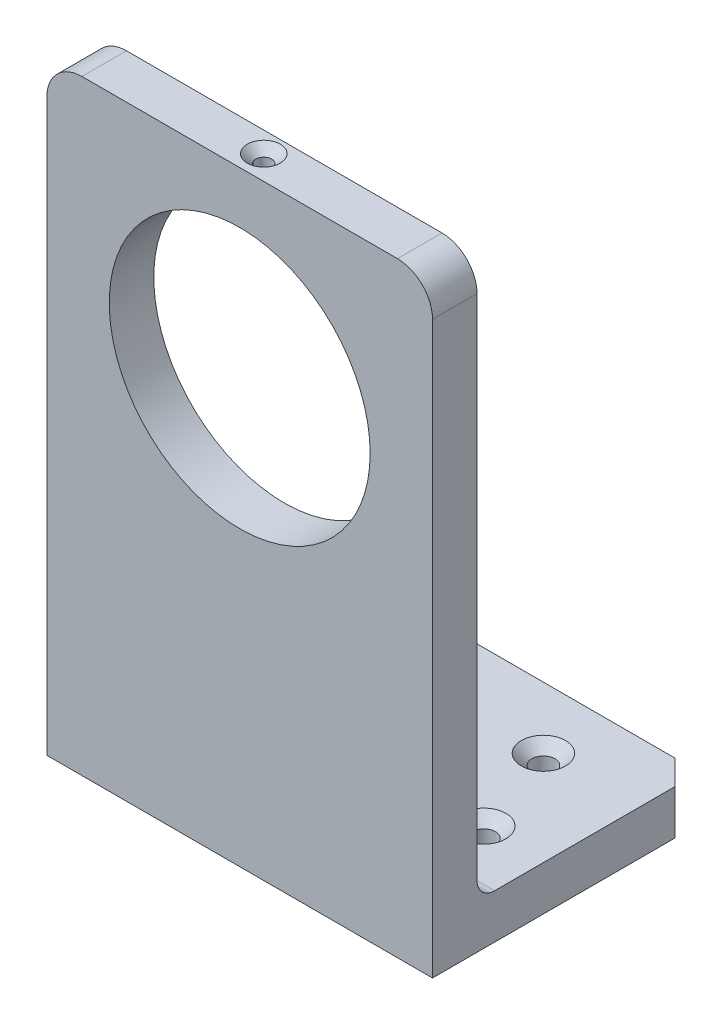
ISO-10303-21;
HEADER;
FILE_DESCRIPTION(('STEP AP214'),'2;1');
FILE_NAME('part.step','',(''),(''),'','','');
FILE_SCHEMA(('AUTOMOTIVE_DESIGN { 1 0 10303 214 1 1 1 1 }'));
ENDSEC;
DATA;
#1=APPLICATION_CONTEXT('core data for automotive mechanical design processes');
#2=APPLICATION_PROTOCOL_DEFINITION('international standard','automotive_design',2000,#1);
#3=PRODUCT_CONTEXT('',#1,'mechanical');
#4=PRODUCT('Part','Part','',(#3));
#5=PRODUCT_RELATED_PRODUCT_CATEGORY('part','',(#4));
#6=PRODUCT_DEFINITION_FORMATION('','',#4);
#7=PRODUCT_DEFINITION_CONTEXT('part definition',#1,'design');
#8=PRODUCT_DEFINITION('design','',#6,#7);
#9=PRODUCT_DEFINITION_SHAPE('','',#8);
#10=(LENGTH_UNIT() NAMED_UNIT(*) SI_UNIT(.MILLI.,.METRE.));
#11=(NAMED_UNIT(*) PLANE_ANGLE_UNIT() SI_UNIT($,.RADIAN.));
#12=(NAMED_UNIT(*) SI_UNIT($,.STERADIAN.) SOLID_ANGLE_UNIT());
#13=UNCERTAINTY_MEASURE_WITH_UNIT(LENGTH_MEASURE(1.E-05),#10,'distance_accuracy_value','');
#14=(GEOMETRIC_REPRESENTATION_CONTEXT(3) GLOBAL_UNCERTAINTY_ASSIGNED_CONTEXT((#13)) GLOBAL_UNIT_ASSIGNED_CONTEXT((#10,
#11,#12)) REPRESENTATION_CONTEXT('',''));
#15=CARTESIAN_POINT('',(0.,0.,0.));
#16=DIRECTION('',(0.,0.,1.));
#17=DIRECTION('',(1.,0.,0.));
#18=AXIS2_PLACEMENT_3D('',#15,#16,#17);
#19=CARTESIAN_POINT('',(-55.,0.,12.7));
#20=DIRECTION('',(0.,0.,1.));
#21=DIRECTION('',(1.,0.,0.));
#22=AXIS2_PLACEMENT_3D('',#19,#20,#21);
#23=PLANE('',#22);
#24=DIRECTION('',(-1.,0.,0.));
#25=VECTOR('',#24,1.);
#26=CARTESIAN_POINT('',(55.,160.,12.7));
#27=LINE('',#26,#25);
#28=CARTESIAN_POINT('',(45.,160.,12.7));
#29=VERTEX_POINT('',#28);
#30=CARTESIAN_POINT('',(-45.,160.,12.7));
#31=VERTEX_POINT('',#30);
#32=EDGE_CURVE('E166',#29,#31,#27,.T.);
#33=ORIENTED_EDGE('',*,*,#32,.T.);
#34=CARTESIAN_POINT('',(-45.,150.,12.7));
#35=DIRECTION('',(0.,0.,1.));
#36=DIRECTION('',(1.,0.,0.));
#37=AXIS2_PLACEMENT_3D('',#34,#35,#36);
#38=CIRCLE('',#37,10.);
#39=CARTESIAN_POINT('',(-55.,150.,12.7));
#40=VERTEX_POINT('',#39);
#41=EDGE_CURVE('E120',#31,#40,#38,.T.);
#42=ORIENTED_EDGE('',*,*,#41,.T.);
#43=DIRECTION('',(0.,-1.,0.));
#44=VECTOR('',#43,1.);
#45=CARTESIAN_POINT('',(-55.,160.,12.7));
#46=LINE('',#45,#44);
#47=CARTESIAN_POINT('',(-55.,-12.7,12.7));
#48=VERTEX_POINT('',#47);
#49=EDGE_CURVE('E112',#40,#48,#46,.T.);
#50=ORIENTED_EDGE('',*,*,#49,.T.);
#51=DIRECTION('',(1.,0.,0.));
#52=VECTOR('',#51,1.);
#53=CARTESIAN_POINT('',(-55.,-12.7,12.7));
#54=LINE('',#53,#52);
#55=CARTESIAN_POINT('',(55.,-12.7,12.7));
#56=VERTEX_POINT('',#55);
#57=EDGE_CURVE('E118',#48,#56,#54,.T.);
#58=ORIENTED_EDGE('',*,*,#57,.T.);
#59=DIRECTION('',(0.,1.,0.));
#60=VECTOR('',#59,1.);
#61=CARTESIAN_POINT('',(55.,160.,12.7));
#62=LINE('',#61,#60);
#63=CARTESIAN_POINT('',(55.,150.,12.7));
#64=VERTEX_POINT('',#63);
#65=EDGE_CURVE('E124',#56,#64,#62,.T.);
#66=ORIENTED_EDGE('',*,*,#65,.T.);
#67=CARTESIAN_POINT('',(45.,150.,12.7));
#68=DIRECTION('',(0.,0.,1.));
#69=DIRECTION('',(1.,0.,0.));
#70=AXIS2_PLACEMENT_3D('',#67,#68,#69);
#71=CIRCLE('',#70,10.);
#72=EDGE_CURVE('E198',#64,#29,#71,.T.);
#73=ORIENTED_EDGE('',*,*,#72,.T.);
#74=EDGE_LOOP('',(#33,#42,#50,#58,#66,#73));
#75=FACE_BOUND('',#74,.T.);
#76=CARTESIAN_POINT('',(0.,108.,12.7));
#77=DIRECTION('',(0.,0.,1.));
#78=DIRECTION('',(1.,0.,0.));
#79=AXIS2_PLACEMENT_3D('',#76,#77,#78);
#80=CIRCLE('',#79,37.211);
#81=CARTESIAN_POINT('',(37.211,108.,12.7));
#82=VERTEX_POINT('',#81);
#83=EDGE_CURVE('E186',#82,#82,#80,.T.);
#84=ORIENTED_EDGE('',*,*,#83,.F.);
#85=EDGE_LOOP('',(#84));
#86=FACE_BOUND('',#85,.T.);
#87=ADVANCED_FACE('F30',(#75,#86),#23,.T.);
#88=CARTESIAN_POINT('',(-55.,0.,0.));
#89=DIRECTION('',(0.,0.,1.));
#90=DIRECTION('',(1.,0.,0.));
#91=AXIS2_PLACEMENT_3D('',#88,#89,#90);
#92=PLANE('',#91);
#93=DIRECTION('',(0.,1.,0.));
#94=VECTOR('',#93,1.);
#95=CARTESIAN_POINT('',(55.,160.,0.));
#96=LINE('',#95,#94);
#97=CARTESIAN_POINT('',(55.,5.,0.));
#98=VERTEX_POINT('',#97);
#99=CARTESIAN_POINT('',(55.,150.,0.));
#100=VERTEX_POINT('',#99);
#101=EDGE_CURVE('E185',#98,#100,#96,.T.);
#102=ORIENTED_EDGE('',*,*,#101,.F.);
#103=DIRECTION('',(1.,0.,0.));
#104=VECTOR('',#103,1.);
#105=CARTESIAN_POINT('',(-55.,5.,0.));
#106=LINE('',#105,#104);
#107=CARTESIAN_POINT('',(-55.,5.,0.));
#108=VERTEX_POINT('',#107);
#109=EDGE_CURVE('E51',#98,#108,#106,.F.);
#110=ORIENTED_EDGE('',*,*,#109,.T.);
#111=DIRECTION('',(0.,-1.,0.));
#112=VECTOR('',#111,1.);
#113=CARTESIAN_POINT('',(-55.,160.,0.));
#114=LINE('',#113,#112);
#115=CARTESIAN_POINT('',(-55.,150.,0.));
#116=VERTEX_POINT('',#115);
#117=EDGE_CURVE('E183',#116,#108,#114,.T.);
#118=ORIENTED_EDGE('',*,*,#117,.F.);
#119=CARTESIAN_POINT('',(-45.,150.,0.));
#120=DIRECTION('',(0.,0.,1.));
#121=DIRECTION('',(1.,0.,0.));
#122=AXIS2_PLACEMENT_3D('',#119,#120,#121);
#123=CIRCLE('',#122,10.);
#124=CARTESIAN_POINT('',(-45.,160.,0.));
#125=VERTEX_POINT('',#124);
#126=EDGE_CURVE('E191',#116,#125,#123,.F.);
#127=ORIENTED_EDGE('',*,*,#126,.T.);
#128=DIRECTION('',(-1.,0.,0.));
#129=VECTOR('',#128,1.);
#130=CARTESIAN_POINT('',(55.,160.,0.));
#131=LINE('',#130,#129);
#132=CARTESIAN_POINT('',(45.,160.,0.));
#133=VERTEX_POINT('',#132);
#134=EDGE_CURVE('E125',#133,#125,#131,.T.);
#135=ORIENTED_EDGE('',*,*,#134,.F.);
#136=CARTESIAN_POINT('',(45.,150.,0.));
#137=DIRECTION('',(0.,0.,1.));
#138=DIRECTION('',(1.,0.,0.));
#139=AXIS2_PLACEMENT_3D('',#136,#137,#138);
#140=CIRCLE('',#139,10.);
#141=EDGE_CURVE('E188',#133,#100,#140,.F.);
#142=ORIENTED_EDGE('',*,*,#141,.T.);
#143=EDGE_LOOP('',(#102,#110,#118,#127,#135,#142));
#144=FACE_BOUND('',#143,.T.);
#145=CARTESIAN_POINT('',(0.,108.,0.));
#146=DIRECTION('',(0.,0.,1.));
#147=DIRECTION('',(1.,0.,0.));
#148=AXIS2_PLACEMENT_3D('',#145,#146,#147);
#149=CIRCLE('',#148,37.211);
#150=CARTESIAN_POINT('',(37.211,108.,0.));
#151=VERTEX_POINT('',#150);
#152=EDGE_CURVE('E160',#151,#151,#149,.T.);
#153=ORIENTED_EDGE('',*,*,#152,.T.);
#154=EDGE_LOOP('',(#153));
#155=FACE_BOUND('',#154,.T.);
#156=ADVANCED_FACE('F221',(#144,#155),#92,.F.);
#157=CARTESIAN_POINT('',(-55.,160.,12.7));
#158=DIRECTION('',(1.,0.,0.));
#159=DIRECTION('',(0.,1.,0.));
#160=AXIS2_PLACEMENT_3D('',#157,#158,#159);
#161=PLANE('',#160);
#162=ORIENTED_EDGE('',*,*,#49,.F.);
#163=DIRECTION('',(0.,0.,-1.));
#164=VECTOR('',#163,1.);
#165=CARTESIAN_POINT('',(-55.,150.,12.7));
#166=LINE('',#165,#164);
#167=EDGE_CURVE('E182',#40,#116,#166,.T.);
#168=ORIENTED_EDGE('',*,*,#167,.T.);
#169=ORIENTED_EDGE('',*,*,#117,.T.);
#170=CARTESIAN_POINT('',(-55.,5.,-5.));
#171=DIRECTION('',(1.,0.,0.));
#172=DIRECTION('',(0.,1.,0.));
#173=AXIS2_PLACEMENT_3D('',#170,#171,#172);
#174=CIRCLE('',#173,5.);
#175=CARTESIAN_POINT('',(-55.,0.,-5.00000000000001));
#176=VERTEX_POINT('',#175);
#177=EDGE_CURVE('E11',#108,#176,#174,.T.);
#178=ORIENTED_EDGE('',*,*,#177,.T.);
#179=DIRECTION('',(0.,0.,1.));
#180=VECTOR('',#179,1.);
#181=CARTESIAN_POINT('',(-55.,0.,-63.5));
#182=LINE('',#181,#180);
#183=CARTESIAN_POINT('',(-55.,0.,-56.5));
#184=VERTEX_POINT('',#183);
#185=EDGE_CURVE('E156',#184,#176,#182,.T.);
#186=ORIENTED_EDGE('',*,*,#185,.F.);
#187=DIRECTION('',(0.,-1.,0.));
#188=VECTOR('',#187,1.);
#189=CARTESIAN_POINT('',(-55.,160.,-56.5));
#190=LINE('',#189,#188);
#191=CARTESIAN_POINT('',(-55.,-12.7,-56.5));
#192=VERTEX_POINT('',#191);
#193=EDGE_CURVE('E133',#184,#192,#190,.T.);
#194=ORIENTED_EDGE('',*,*,#193,.T.);
#195=DIRECTION('',(0.,0.,1.));
#196=VECTOR('',#195,1.);
#197=CARTESIAN_POINT('',(-55.,-12.7,-63.5));
#198=LINE('',#197,#196);
#199=EDGE_CURVE('E129',#192,#48,#198,.T.);
#200=ORIENTED_EDGE('',*,*,#199,.T.);
#201=EDGE_LOOP('',(#162,#168,#169,#178,#186,#194,#200));
#202=FACE_BOUND('',#201,.T.);
#203=ADVANCED_FACE('F130',(#202),#161,.F.);
#204=CARTESIAN_POINT('',(55.,160.,12.7));
#205=DIRECTION('',(-1.,0.,0.));
#206=DIRECTION('',(0.,-1.,0.));
#207=AXIS2_PLACEMENT_3D('',#204,#205,#206);
#208=PLANE('',#207);
#209=DIRECTION('',(0.,0.,1.));
#210=VECTOR('',#209,1.);
#211=CARTESIAN_POINT('',(55.,0.,-63.5));
#212=LINE('',#211,#210);
#213=CARTESIAN_POINT('',(55.,0.,-56.5));
#214=VERTEX_POINT('',#213);
#215=CARTESIAN_POINT('',(55.,0.,-5.00000000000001));
#216=VERTEX_POINT('',#215);
#217=EDGE_CURVE('E161',#214,#216,#212,.T.);
#218=ORIENTED_EDGE('',*,*,#217,.T.);
#219=CARTESIAN_POINT('',(55.,5.,-5.));
#220=DIRECTION('',(-1.,0.,0.));
#221=DIRECTION('',(0.,-1.,0.));
#222=AXIS2_PLACEMENT_3D('',#219,#220,#221);
#223=CIRCLE('',#222,5.);
#224=EDGE_CURVE('E38',#216,#98,#223,.T.);
#225=ORIENTED_EDGE('',*,*,#224,.T.);
#226=ORIENTED_EDGE('',*,*,#101,.T.);
#227=DIRECTION('',(0.,0.,-1.));
#228=VECTOR('',#227,1.);
#229=CARTESIAN_POINT('',(55.,150.,12.7));
#230=LINE('',#229,#228);
#231=EDGE_CURVE('E201',#100,#64,#230,.F.);
#232=ORIENTED_EDGE('',*,*,#231,.T.);
#233=ORIENTED_EDGE('',*,*,#65,.F.);
#234=DIRECTION('',(0.,0.,1.));
#235=VECTOR('',#234,1.);
#236=CARTESIAN_POINT('',(55.,-12.7,-63.5));
#237=LINE('',#236,#235);
#238=CARTESIAN_POINT('',(55.,-12.7,-56.5));
#239=VERTEX_POINT('',#238);
#240=EDGE_CURVE('E135',#239,#56,#237,.T.);
#241=ORIENTED_EDGE('',*,*,#240,.F.);
#242=DIRECTION('',(0.,1.,0.));
#243=VECTOR('',#242,1.);
#244=CARTESIAN_POINT('',(55.,160.,-56.5));
#245=LINE('',#244,#243);
#246=EDGE_CURVE('E179',#239,#214,#245,.T.);
#247=ORIENTED_EDGE('',*,*,#246,.T.);
#248=EDGE_LOOP('',(#218,#225,#226,#232,#233,#241,#247));
#249=FACE_BOUND('',#248,.T.);
#250=ADVANCED_FACE('F233',(#249),#208,.F.);
#251=CARTESIAN_POINT('',(55.,160.,12.7));
#252=DIRECTION('',(0.,-1.,0.));
#253=DIRECTION('',(0.,0.,-1.));
#254=AXIS2_PLACEMENT_3D('',#251,#252,#253);
#255=PLANE('',#254);
#256=CARTESIAN_POINT('',(0.,160.,5.83424471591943));
#257=DIRECTION('',(0.,1.,0.));
#258=DIRECTION('',(0.,0.,1.));
#259=AXIS2_PLACEMENT_3D('',#256,#257,#258);
#260=CIRCLE('',#259,4.7);
#261=CARTESIAN_POINT('',(0.,160.,10.5342447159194));
#262=VERTEX_POINT('',#261);
#263=EDGE_CURVE('E349',#262,#262,#260,.T.);
#264=ORIENTED_EDGE('',*,*,#263,.F.);
#265=EDGE_LOOP('',(#264));
#266=FACE_BOUND('',#265,.T.);
#267=ORIENTED_EDGE('',*,*,#134,.T.);
#268=DIRECTION('',(0.,0.,-1.));
#269=VECTOR('',#268,1.);
#270=CARTESIAN_POINT('',(-45.,160.,12.7));
#271=LINE('',#270,#269);
#272=EDGE_CURVE('E196',#125,#31,#271,.F.);
#273=ORIENTED_EDGE('',*,*,#272,.T.);
#274=ORIENTED_EDGE('',*,*,#32,.F.);
#275=DIRECTION('',(0.,0.,-1.));
#276=VECTOR('',#275,1.);
#277=CARTESIAN_POINT('',(45.,160.,12.7));
#278=LINE('',#277,#276);
#279=EDGE_CURVE('E193',#29,#133,#278,.T.);
#280=ORIENTED_EDGE('',*,*,#279,.T.);
#281=EDGE_LOOP('',(#267,#273,#274,#280));
#282=FACE_BOUND('',#281,.T.);
#283=ADVANCED_FACE('F230',(#266,#282),#255,.F.);
#284=CARTESIAN_POINT('',(0.,108.,12.7));
#285=DIRECTION('',(0.,0.,-1.));
#286=DIRECTION('',(-1.,0.,0.));
#287=AXIS2_PLACEMENT_3D('',#284,#285,#286);
#288=CYLINDRICAL_SURFACE('',#287,37.211);
#289=CARTESIAN_POINT('',(0.,145.211,8.08424471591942));
#290=CARTESIAN_POINT('',(-0.126259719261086,145.210999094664,8.08423915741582));
#291=CARTESIAN_POINT('',(-0.252608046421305,145.210350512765,8.0735813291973));
#292=CARTESIAN_POINT('',(-0.501816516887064,145.207825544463,8.03121778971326));
#293=CARTESIAN_POINT('',(-0.624672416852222,145.205947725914,7.99948752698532));
#294=CARTESIAN_POINT('',(-0.863250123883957,145.201176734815,7.91589330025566));
#295=CARTESIAN_POINT('',(-0.978975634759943,145.19828409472,7.8640398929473));
#296=CARTESIAN_POINT('',(-1.20004966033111,145.191808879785,7.74168826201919));
#297=CARTESIAN_POINT('',(-1.3054005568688,145.188226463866,7.67119433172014));
#298=CARTESIAN_POINT('',(-1.50291393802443,145.180768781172,7.51345347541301));
#299=CARTESIAN_POINT('',(-1.59505986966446,145.176893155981,7.42618583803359));
#300=CARTESIAN_POINT('',(-1.76340615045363,145.169288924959,7.23741727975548));
#301=CARTESIAN_POINT('',(-1.8396058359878,145.165560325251,7.13591576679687));
#302=CARTESIAN_POINT('',(-1.97394688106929,145.158667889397,6.92146790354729));
#303=CARTESIAN_POINT('',(-2.03207459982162,145.15550448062,6.80851299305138));
#304=CARTESIAN_POINT('',(-2.12853436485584,145.150103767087,6.57442475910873));
#305=CARTESIAN_POINT('',(-2.16686661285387,145.147866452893,6.45329151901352));
#306=CARTESIAN_POINT('',(-2.22260167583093,145.144573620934,6.20644367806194));
#307=CARTESIAN_POINT('',(-2.24003026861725,145.143516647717,6.08073491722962));
#308=CARTESIAN_POINT('',(-2.2535428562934,145.142699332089,5.82817200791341));
#309=CARTESIAN_POINT('',(-2.24962707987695,145.142938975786,5.70131787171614));
#310=CARTESIAN_POINT('',(-2.22058348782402,145.144686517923,5.45024070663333));
#311=CARTESIAN_POINT('',(-2.19548355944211,145.146192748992,5.32601443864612));
#312=CARTESIAN_POINT('',(-2.12482740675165,145.150301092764,5.08354165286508));
#313=CARTESIAN_POINT('',(-2.07927106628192,145.15290321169,4.96529516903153));
#314=CARTESIAN_POINT('',(-1.96896357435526,145.158912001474,4.73804889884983));
#315=CARTESIAN_POINT('',(-1.90419976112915,145.162319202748,4.62905527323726));
#316=CARTESIAN_POINT('',(-1.75732491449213,145.169553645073,4.42347600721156));
#317=CARTESIAN_POINT('',(-1.67521369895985,145.173380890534,4.3268904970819));
#318=CARTESIAN_POINT('',(-1.49581776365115,145.181031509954,4.1487069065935));
#319=CARTESIAN_POINT('',(-1.39850890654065,145.184854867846,4.06713312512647));
#320=CARTESIAN_POINT('',(-1.19156458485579,145.192060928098,3.92147596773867));
#321=CARTESIAN_POINT('',(-1.08192911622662,145.195443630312,3.85739259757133));
#322=CARTESIAN_POINT('',(-0.853429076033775,145.20138743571,3.74853746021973));
#323=CARTESIAN_POINT('',(-0.73456407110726,145.203948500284,3.70376660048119));
#324=CARTESIAN_POINT('',(-0.490985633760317,145.207959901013,3.63482353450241));
#325=CARTESIAN_POINT('',(-0.366272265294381,145.20941024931,3.61065110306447));
#326=CARTESIAN_POINT('',(-0.114748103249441,145.21103521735,3.5836211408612));
#327=CARTESIAN_POINT('',(0.0120590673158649,145.211211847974,3.58073001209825));
#328=CARTESIAN_POINT('',(0.264356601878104,145.210274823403,3.59625695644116));
#329=CARTESIAN_POINT('',(0.389846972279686,145.209161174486,3.6146749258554));
#330=CARTESIAN_POINT('',(0.635854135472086,145.205770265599,3.67226943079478));
#331=CARTESIAN_POINT('',(0.75637454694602,145.203493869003,3.71143056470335));
#332=CARTESIAN_POINT('',(0.989132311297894,145.198033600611,3.80938412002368));
#333=CARTESIAN_POINT('',(1.10136959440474,145.194849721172,3.86817670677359));
#334=CARTESIAN_POINT('',(1.31452902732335,145.187927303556,4.00380987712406));
#335=CARTESIAN_POINT('',(1.41543686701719,145.184188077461,4.08067291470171));
#336=CARTESIAN_POINT('',(1.6029289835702,145.176578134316,4.25023242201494));
#337=CARTESIAN_POINT('',(1.68951312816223,145.172707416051,4.34292903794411));
#338=CARTESIAN_POINT('',(1.84601373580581,145.165264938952,4.54166926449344));
#339=CARTESIAN_POINT('',(1.91590841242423,145.161693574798,4.64773004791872));
#340=CARTESIAN_POINT('',(2.0368970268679,145.155258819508,4.87010154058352));
#341=CARTESIAN_POINT('',(2.08799107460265,145.152395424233,4.98641218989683));
#342=CARTESIAN_POINT('',(2.16989028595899,145.147702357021,5.22590200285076));
#343=CARTESIAN_POINT('',(2.20070919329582,145.145871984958,5.34907645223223));
#344=CARTESIAN_POINT('',(2.24122818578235,145.143449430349,5.59886296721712));
#345=CARTESIAN_POINT('',(2.25092846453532,145.142857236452,5.72547500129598));
#346=CARTESIAN_POINT('',(2.24893299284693,145.142978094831,5.97832596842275));
#347=CARTESIAN_POINT('',(2.23727149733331,145.143689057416,6.10456517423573));
#348=CARTESIAN_POINT('',(2.19295448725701,145.146331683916,6.35328965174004));
#349=CARTESIAN_POINT('',(2.16029893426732,145.148263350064,6.47577491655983));
#350=CARTESIAN_POINT('',(2.07492837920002,145.153129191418,6.71352009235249));
#351=CARTESIAN_POINT('',(2.02221346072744,145.156063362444,6.82878003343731));
#352=CARTESIAN_POINT('',(1.89822543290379,145.162603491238,7.04881756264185));
#353=CARTESIAN_POINT('',(1.82695281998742,145.166209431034,7.15359543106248));
#354=CARTESIAN_POINT('',(1.66774643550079,145.173693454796,7.34986792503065));
#355=CARTESIAN_POINT('',(1.57978801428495,145.177571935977,7.44134254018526));
#356=CARTESIAN_POINT('',(1.38973778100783,145.185160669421,7.6082586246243));
#357=CARTESIAN_POINT('',(1.28764251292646,145.188870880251,7.683696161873));
#358=CARTESIAN_POINT('',(1.07210692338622,145.195708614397,7.81644860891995));
#359=CARTESIAN_POINT('',(0.958653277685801,145.198835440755,7.87374189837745));
#360=CARTESIAN_POINT('',(0.723800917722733,145.204144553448,7.96839676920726));
#361=CARTESIAN_POINT('',(0.602411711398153,145.206327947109,8.00578172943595));
#362=CARTESIAN_POINT('',(0.400231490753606,145.208931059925,8.04982616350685));
#363=CARTESIAN_POINT('',(0.320747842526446,145.209703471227,8.06271646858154));
#364=CARTESIAN_POINT('',(0.160854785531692,145.21073822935,8.0799275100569));
#365=CARTESIAN_POINT('',(0.0804453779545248,145.211000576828,8.08424825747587));
#366=CARTESIAN_POINT('',(0.,145.211,8.08424471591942));
#367=B_SPLINE_CURVE_WITH_KNOTS('',3,(#289,#290,#291,#292,#293,#294,#295,#296,#297,#298,#299,
#300,#301,#302,#303,#304,#305,#306,#307,#308,#309,#310,#311,#312,#313,#314,#315,#316,#317,#318,
#319,#320,#321,#322,#323,#324,#325,#326,#327,#328,#329,#330,#331,#332,#333,#334,#335,#336,#337,
#338,#339,#340,#341,#342,#343,#344,#345,#346,#347,#348,#349,#350,#351,#352,#353,#354,#355,#356,
#357,#358,#359,#360,#361,#362,#363,#364,#365,#366),.UNSPECIFIED.,.T.,.F.,(4,2,2,2,2,2,2,2,2,2,2,
2,2,2,2,2,2,2,2,2,2,2,2,2,2,2,2,2,2,2,2,2,2,2,2,2,2,2,4),(0.,0.378485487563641,
0.757412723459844,1.13614144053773,1.51478300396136,1.89389513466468,2.27302303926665,
2.65243642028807,3.03184593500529,3.41078708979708,3.78972418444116,4.16816321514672,
4.54660439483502,4.92529560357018,5.30399078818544,5.68329366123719,6.06259665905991,
6.44191747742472,6.82123414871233,7.19995184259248,7.57866769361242,7.95710274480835,
8.33554098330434,8.71445197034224,9.09336645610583,9.47277290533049,9.85217713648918,
10.2313239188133,10.6104672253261,10.9890030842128,11.3675396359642,11.7460746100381,
12.1245994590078,12.5036879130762,12.8828692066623,13.262500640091,13.6416852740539,
13.8828346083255,14.1239836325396),.UNSPECIFIED.);
#368=CARTESIAN_POINT('',(0.,145.211,8.08424471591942));
#369=VERTEX_POINT('',#368);
#370=EDGE_CURVE('E342',#369,#369,#367,.T.);
#371=ORIENTED_EDGE('',*,*,#370,.F.);
#372=EDGE_LOOP('',(#371));
#373=FACE_BOUND('',#372,.T.);
#374=ORIENTED_EDGE('',*,*,#83,.T.);
#375=EDGE_LOOP('',(#374));
#376=FACE_BOUND('',#375,.T.);
#377=ORIENTED_EDGE('',*,*,#152,.F.);
#378=EDGE_LOOP('',(#377));
#379=FACE_BOUND('',#378,.T.);
#380=ADVANCED_FACE('F218',(#373,#376,#379),#288,.F.);
#381=CARTESIAN_POINT('',(-55.,0.,-63.5));
#382=DIRECTION('',(0.,1.,0.));
#383=DIRECTION('',(0.,0.,1.));
#384=AXIS2_PLACEMENT_3D('',#381,#382,#383);
#385=PLANE('',#384);
#386=CARTESIAN_POINT('',(-30.,0.,-45.9319172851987));
#387=DIRECTION('',(0.,1.,0.));
#388=DIRECTION('',(0.,0.,1.));
#389=AXIS2_PLACEMENT_3D('',#386,#387,#388);
#390=CIRCLE('',#389,6.3);
#391=CARTESIAN_POINT('',(-30.,0.,-39.6319172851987));
#392=VERTEX_POINT('',#391);
#393=EDGE_CURVE('E304',#392,#392,#390,.T.);
#394=ORIENTED_EDGE('',*,*,#393,.F.);
#395=EDGE_LOOP('',(#394));
#396=FACE_BOUND('',#395,.T.);
#397=CARTESIAN_POINT('',(28.,0.,-45.9319172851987));
#398=DIRECTION('',(0.,1.,0.));
#399=DIRECTION('',(0.,0.,1.));
#400=AXIS2_PLACEMENT_3D('',#397,#398,#399);
#401=CIRCLE('',#400,6.3);
#402=CARTESIAN_POINT('',(28.,0.,-39.6319172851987));
#403=VERTEX_POINT('',#402);
#404=EDGE_CURVE('E308',#403,#403,#401,.T.);
#405=ORIENTED_EDGE('',*,*,#404,.F.);
#406=EDGE_LOOP('',(#405));
#407=FACE_BOUND('',#406,.T.);
#408=CARTESIAN_POINT('',(37.5,0.,-19.4326116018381));
#409=DIRECTION('',(0.,1.,0.));
#410=DIRECTION('',(0.,0.,1.));
#411=AXIS2_PLACEMENT_3D('',#408,#409,#410);
#412=CIRCLE('',#411,6.3);
#413=CARTESIAN_POINT('',(37.5,0.,-13.1326116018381));
#414=VERTEX_POINT('',#413);
#415=EDGE_CURVE('E312',#414,#414,#412,.T.);
#416=ORIENTED_EDGE('',*,*,#415,.F.);
#417=EDGE_LOOP('',(#416));
#418=FACE_BOUND('',#417,.T.);
#419=CARTESIAN_POINT('',(-37.5,0.,-19.4326116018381));
#420=DIRECTION('',(0.,1.,0.));
#421=DIRECTION('',(0.,0.,1.));
#422=AXIS2_PLACEMENT_3D('',#419,#420,#421);
#423=CIRCLE('',#422,6.3);
#424=CARTESIAN_POINT('',(-37.5,0.,-13.1326116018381));
#425=VERTEX_POINT('',#424);
#426=EDGE_CURVE('E315',#425,#425,#423,.T.);
#427=ORIENTED_EDGE('',*,*,#426,.F.);
#428=EDGE_LOOP('',(#427));
#429=FACE_BOUND('',#428,.T.);
#430=ORIENTED_EDGE('',*,*,#185,.T.);
#431=DIRECTION('',(1.,0.,0.));
#432=VECTOR('',#431,1.);
#433=CARTESIAN_POINT('',(-55.,0.,-5.));
#434=LINE('',#433,#432);
#435=EDGE_CURVE('E203',#176,#216,#434,.T.);
#436=ORIENTED_EDGE('',*,*,#435,.T.);
#437=ORIENTED_EDGE('',*,*,#217,.F.);
#438=DIRECTION('',(0.707106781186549,0.,0.707106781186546));
#439=VECTOR('',#438,1.);
#440=CARTESIAN_POINT('',(-3.5000000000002,0.,-115.));
#441=LINE('',#440,#439);
#442=CARTESIAN_POINT('',(48.,0.,-63.5));
#443=VERTEX_POINT('',#442);
#444=EDGE_CURVE('E174',#214,#443,#441,.F.);
#445=ORIENTED_EDGE('',*,*,#444,.T.);
#446=DIRECTION('',(-1.,0.,0.));
#447=VECTOR('',#446,1.);
#448=CARTESIAN_POINT('',(-55.,0.,-63.5));
#449=LINE('',#448,#447);
#450=CARTESIAN_POINT('',(-48.,0.,-63.5));
#451=VERTEX_POINT('',#450);
#452=EDGE_CURVE('E136',#443,#451,#449,.T.);
#453=ORIENTED_EDGE('',*,*,#452,.T.);
#454=DIRECTION('',(0.707106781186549,0.,-0.707106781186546));
#455=VECTOR('',#454,1.);
#456=CARTESIAN_POINT('',(-51.5,0.,-60.));
#457=LINE('',#456,#455);
#458=EDGE_CURVE('E177',#451,#184,#457,.F.);
#459=ORIENTED_EDGE('',*,*,#458,.T.);
#460=EDGE_LOOP('',(#430,#436,#437,#445,#453,#459));
#461=FACE_BOUND('',#460,.T.);
#462=ADVANCED_FACE('F270',(#396,#407,#418,#429,#461),#385,.T.);
#463=CARTESIAN_POINT('',(-55.,-12.7,-63.5));
#464=DIRECTION('',(0.,-1.,0.));
#465=DIRECTION('',(1.,0.,0.));
#466=AXIS2_PLACEMENT_3D('',#463,#464,#465);
#467=PLANE('',#466);
#468=CARTESIAN_POINT('',(-30.,-12.7,-45.9319172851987));
#469=DIRECTION('',(0.,1.,0.));
#470=DIRECTION('',(0.,0.,1.));
#471=AXIS2_PLACEMENT_3D('',#468,#469,#470);
#472=CIRCLE('',#471,3.3);
#473=CARTESIAN_POINT('',(-30.,-12.7,-42.6319172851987));
#474=VERTEX_POINT('',#473);
#475=EDGE_CURVE('E335',#474,#474,#472,.T.);
#476=ORIENTED_EDGE('',*,*,#475,.T.);
#477=EDGE_LOOP('',(#476));
#478=FACE_BOUND('',#477,.T.);
#479=CARTESIAN_POINT('',(28.,-12.7,-45.9319172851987));
#480=DIRECTION('',(0.,1.,0.));
#481=DIRECTION('',(0.,0.,1.));
#482=AXIS2_PLACEMENT_3D('',#479,#480,#481);
#483=CIRCLE('',#482,3.3);
#484=CARTESIAN_POINT('',(28.,-12.7,-42.6319172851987));
#485=VERTEX_POINT('',#484);
#486=EDGE_CURVE('E328',#485,#485,#483,.T.);
#487=ORIENTED_EDGE('',*,*,#486,.T.);
#488=EDGE_LOOP('',(#487));
#489=FACE_BOUND('',#488,.T.);
#490=CARTESIAN_POINT('',(37.5,-12.7,-19.4326116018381));
#491=DIRECTION('',(0.,1.,0.));
#492=DIRECTION('',(0.,0.,1.));
#493=AXIS2_PLACEMENT_3D('',#490,#491,#492);
#494=CIRCLE('',#493,3.3);
#495=CARTESIAN_POINT('',(37.5,-12.7,-16.1326116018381));
#496=VERTEX_POINT('',#495);
#497=EDGE_CURVE('E317',#496,#496,#494,.T.);
#498=ORIENTED_EDGE('',*,*,#497,.T.);
#499=EDGE_LOOP('',(#498));
#500=FACE_BOUND('',#499,.T.);
#501=CARTESIAN_POINT('',(-37.5,-12.7,-19.4326116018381));
#502=DIRECTION('',(0.,1.,0.));
#503=DIRECTION('',(0.,0.,1.));
#504=AXIS2_PLACEMENT_3D('',#501,#502,#503);
#505=CIRCLE('',#504,3.3);
#506=CARTESIAN_POINT('',(-37.5,-12.7,-16.1326116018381));
#507=VERTEX_POINT('',#506);
#508=EDGE_CURVE('E142',#507,#507,#505,.T.);
#509=ORIENTED_EDGE('',*,*,#508,.T.);
#510=EDGE_LOOP('',(#509));
#511=FACE_BOUND('',#510,.T.);
#512=ORIENTED_EDGE('',*,*,#199,.F.);
#513=DIRECTION('',(-0.707106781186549,0.,0.707106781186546));
#514=VECTOR('',#513,1.);
#515=CARTESIAN_POINT('',(-51.5,-12.7,-60.));
#516=LINE('',#515,#514);
#517=CARTESIAN_POINT('',(-48.,-12.7,-63.5));
#518=VERTEX_POINT('',#517);
#519=EDGE_CURVE('E168',#192,#518,#516,.F.);
#520=ORIENTED_EDGE('',*,*,#519,.T.);
#521=DIRECTION('',(1.,0.,0.));
#522=VECTOR('',#521,1.);
#523=CARTESIAN_POINT('',(-55.,-12.7,-63.5));
#524=LINE('',#523,#522);
#525=CARTESIAN_POINT('',(48.,-12.7,-63.5));
#526=VERTEX_POINT('',#525);
#527=EDGE_CURVE('E141',#518,#526,#524,.T.);
#528=ORIENTED_EDGE('',*,*,#527,.T.);
#529=DIRECTION('',(-0.707106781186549,0.,-0.707106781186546));
#530=VECTOR('',#529,1.);
#531=CARTESIAN_POINT('',(-3.5000000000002,-12.7,-115.));
#532=LINE('',#531,#530);
#533=EDGE_CURVE('E165',#526,#239,#532,.F.);
#534=ORIENTED_EDGE('',*,*,#533,.T.);
#535=ORIENTED_EDGE('',*,*,#240,.T.);
#536=ORIENTED_EDGE('',*,*,#57,.F.);
#537=EDGE_LOOP('',(#512,#520,#528,#534,#535,#536));
#538=FACE_BOUND('',#537,.T.);
#539=ADVANCED_FACE('F138',(#478,#489,#500,#511,#538),#467,.T.);
#540=CARTESIAN_POINT('',(-55.,0.,-63.5));
#541=DIRECTION('',(0.,0.,1.));
#542=DIRECTION('',(1.,0.,0.));
#543=AXIS2_PLACEMENT_3D('',#540,#541,#542);
#544=PLANE('',#543);
#545=ORIENTED_EDGE('',*,*,#527,.F.);
#546=DIRECTION('',(0.,1.,0.));
#547=VECTOR('',#546,1.);
#548=CARTESIAN_POINT('',(-48.,0.,-63.5));
#549=LINE('',#548,#547);
#550=EDGE_CURVE('E172',#518,#451,#549,.T.);
#551=ORIENTED_EDGE('',*,*,#550,.T.);
#552=ORIENTED_EDGE('',*,*,#452,.F.);
#553=DIRECTION('',(0.,-1.,0.));
#554=VECTOR('',#553,1.);
#555=CARTESIAN_POINT('',(48.,0.,-63.5));
#556=LINE('',#555,#554);
#557=EDGE_CURVE('E170',#443,#526,#556,.T.);
#558=ORIENTED_EDGE('',*,*,#557,.T.);
#559=EDGE_LOOP('',(#545,#551,#552,#558));
#560=FACE_BOUND('',#559,.T.);
#561=ADVANCED_FACE('F279',(#560),#544,.F.);
#562=CARTESIAN_POINT('',(-37.5,0.,-19.4326116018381));
#563=DIRECTION('',(0.,1.,0.));
#564=DIRECTION('',(0.,0.,1.));
#565=AXIS2_PLACEMENT_3D('',#562,#563,#564);
#566=CYLINDRICAL_SURFACE('',#565,3.29999999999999);
#567=ORIENTED_EDGE('',*,*,#508,.F.);
#568=EDGE_LOOP('',(#567));
#569=FACE_BOUND('',#568,.T.);
#570=CARTESIAN_POINT('',(-37.5,-3.00000000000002,-19.4326116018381));
#571=DIRECTION('',(0.,1.,0.));
#572=DIRECTION('',(0.,0.,1.));
#573=AXIS2_PLACEMENT_3D('',#570,#571,#572);
#574=CIRCLE('',#573,3.29999999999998);
#575=CARTESIAN_POINT('',(-37.5,-3.00000000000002,-16.1326116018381));
#576=VERTEX_POINT('',#575);
#577=EDGE_CURVE('E147',#576,#576,#574,.T.);
#578=ORIENTED_EDGE('',*,*,#577,.T.);
#579=EDGE_LOOP('',(#578));
#580=FACE_BOUND('',#579,.T.);
#581=ADVANCED_FACE('F283',(#569,#580),#566,.F.);
#582=CARTESIAN_POINT('',(-37.5,0.,-19.4326116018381));
#583=DIRECTION('',(0.,1.,0.));
#584=DIRECTION('',(0.,0.,1.));
#585=AXIS2_PLACEMENT_3D('',#582,#583,#584);
#586=CONICAL_SURFACE('',#585,6.3,0.785398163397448);
#587=ORIENTED_EDGE('',*,*,#577,.F.);
#588=EDGE_LOOP('',(#587));
#589=FACE_BOUND('',#588,.T.);
#590=ORIENTED_EDGE('',*,*,#426,.T.);
#591=EDGE_LOOP('',(#590));
#592=FACE_BOUND('',#591,.T.);
#593=ADVANCED_FACE('F289',(#589,#592),#586,.F.);
#594=CARTESIAN_POINT('',(37.5,0.,-19.4326116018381));
#595=DIRECTION('',(0.,1.,0.));
#596=DIRECTION('',(0.,0.,1.));
#597=AXIS2_PLACEMENT_3D('',#594,#595,#596);
#598=CYLINDRICAL_SURFACE('',#597,3.29999999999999);
#599=ORIENTED_EDGE('',*,*,#497,.F.);
#600=EDGE_LOOP('',(#599));
#601=FACE_BOUND('',#600,.T.);
#602=CARTESIAN_POINT('',(37.5,-3.00000000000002,-19.4326116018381));
#603=DIRECTION('',(0.,1.,0.));
#604=DIRECTION('',(0.,0.,1.));
#605=AXIS2_PLACEMENT_3D('',#602,#603,#604);
#606=CIRCLE('',#605,3.29999999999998);
#607=CARTESIAN_POINT('',(37.5,-3.00000000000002,-16.1326116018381));
#608=VERTEX_POINT('',#607);
#609=EDGE_CURVE('E322',#608,#608,#606,.T.);
#610=ORIENTED_EDGE('',*,*,#609,.T.);
#611=EDGE_LOOP('',(#610));
#612=FACE_BOUND('',#611,.T.);
#613=ADVANCED_FACE('F448',(#601,#612),#598,.F.);
#614=CARTESIAN_POINT('',(37.5,0.,-19.4326116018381));
#615=DIRECTION('',(0.,1.,0.));
#616=DIRECTION('',(0.,0.,1.));
#617=AXIS2_PLACEMENT_3D('',#614,#615,#616);
#618=CONICAL_SURFACE('',#617,6.3,0.785398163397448);
#619=ORIENTED_EDGE('',*,*,#609,.F.);
#620=EDGE_LOOP('',(#619));
#621=FACE_BOUND('',#620,.T.);
#622=ORIENTED_EDGE('',*,*,#415,.T.);
#623=EDGE_LOOP('',(#622));
#624=FACE_BOUND('',#623,.T.);
#625=ADVANCED_FACE('F456',(#621,#624),#618,.F.);
#626=CARTESIAN_POINT('',(28.,0.,-45.9319172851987));
#627=DIRECTION('',(0.,1.,0.));
#628=DIRECTION('',(0.,0.,1.));
#629=AXIS2_PLACEMENT_3D('',#626,#627,#628);
#630=CYLINDRICAL_SURFACE('',#629,3.29999999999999);
#631=ORIENTED_EDGE('',*,*,#486,.F.);
#632=EDGE_LOOP('',(#631));
#633=FACE_BOUND('',#632,.T.);
#634=CARTESIAN_POINT('',(28.,-3.00000000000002,-45.9319172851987));
#635=DIRECTION('',(0.,1.,0.));
#636=DIRECTION('',(0.,0.,1.));
#637=AXIS2_PLACEMENT_3D('',#634,#635,#636);
#638=CIRCLE('',#637,3.29999999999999);
#639=CARTESIAN_POINT('',(28.,-3.00000000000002,-42.6319172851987));
#640=VERTEX_POINT('',#639);
#641=EDGE_CURVE('E331',#640,#640,#638,.T.);
#642=ORIENTED_EDGE('',*,*,#641,.T.);
#643=EDGE_LOOP('',(#642));
#644=FACE_BOUND('',#643,.T.);
#645=ADVANCED_FACE('F465',(#633,#644),#630,.F.);
#646=CARTESIAN_POINT('',(28.,0.,-45.9319172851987));
#647=DIRECTION('',(0.,1.,0.));
#648=DIRECTION('',(0.,0.,1.));
#649=AXIS2_PLACEMENT_3D('',#646,#647,#648);
#650=CONICAL_SURFACE('',#649,6.3,0.785398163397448);
#651=ORIENTED_EDGE('',*,*,#641,.F.);
#652=EDGE_LOOP('',(#651));
#653=FACE_BOUND('',#652,.T.);
#654=ORIENTED_EDGE('',*,*,#404,.T.);
#655=EDGE_LOOP('',(#654));
#656=FACE_BOUND('',#655,.T.);
#657=ADVANCED_FACE('F474',(#653,#656),#650,.F.);
#658=CARTESIAN_POINT('',(-30.,0.,-45.9319172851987));
#659=DIRECTION('',(0.,1.,0.));
#660=DIRECTION('',(0.,0.,1.));
#661=AXIS2_PLACEMENT_3D('',#658,#659,#660);
#662=CYLINDRICAL_SURFACE('',#661,3.29999999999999);
#663=ORIENTED_EDGE('',*,*,#475,.F.);
#664=EDGE_LOOP('',(#663));
#665=FACE_BOUND('',#664,.T.);
#666=CARTESIAN_POINT('',(-30.,-3.00000000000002,-45.9319172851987));
#667=DIRECTION('',(0.,1.,0.));
#668=DIRECTION('',(0.,0.,1.));
#669=AXIS2_PLACEMENT_3D('',#666,#667,#668);
#670=CIRCLE('',#669,3.29999999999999);
#671=CARTESIAN_POINT('',(-30.,-3.00000000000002,-42.6319172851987));
#672=VERTEX_POINT('',#671);
#673=EDGE_CURVE('E338',#672,#672,#670,.T.);
#674=ORIENTED_EDGE('',*,*,#673,.T.);
#675=EDGE_LOOP('',(#674));
#676=FACE_BOUND('',#675,.T.);
#677=ADVANCED_FACE('F483',(#665,#676),#662,.F.);
#678=CARTESIAN_POINT('',(-30.,0.,-45.9319172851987));
#679=DIRECTION('',(0.,1.,0.));
#680=DIRECTION('',(0.,0.,1.));
#681=AXIS2_PLACEMENT_3D('',#678,#679,#680);
#682=CONICAL_SURFACE('',#681,6.3,0.785398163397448);
#683=ORIENTED_EDGE('',*,*,#673,.F.);
#684=EDGE_LOOP('',(#683));
#685=FACE_BOUND('',#684,.T.);
#686=ORIENTED_EDGE('',*,*,#393,.T.);
#687=EDGE_LOOP('',(#686));
#688=FACE_BOUND('',#687,.T.);
#689=ADVANCED_FACE('F243',(#685,#688),#682,.F.);
#690=CARTESIAN_POINT('',(-55.,160.,-56.5));
#691=DIRECTION('',(0.707106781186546,0.,0.707106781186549));
#692=DIRECTION('',(0.707106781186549,0.,-0.707106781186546));
#693=AXIS2_PLACEMENT_3D('',#690,#691,#692);
#694=PLANE('',#693);
#695=ORIENTED_EDGE('',*,*,#458,.F.);
#696=ORIENTED_EDGE('',*,*,#550,.F.);
#697=ORIENTED_EDGE('',*,*,#519,.F.);
#698=ORIENTED_EDGE('',*,*,#193,.F.);
#699=EDGE_LOOP('',(#695,#696,#697,#698));
#700=FACE_BOUND('',#699,.T.);
#701=ADVANCED_FACE('F239',(#700),#694,.F.);
#702=CARTESIAN_POINT('',(55.,160.,-56.5));
#703=DIRECTION('',(-0.707106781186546,0.,0.707106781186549));
#704=DIRECTION('',(0.707106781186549,0.,0.707106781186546));
#705=AXIS2_PLACEMENT_3D('',#702,#703,#704);
#706=PLANE('',#705);
#707=ORIENTED_EDGE('',*,*,#533,.F.);
#708=ORIENTED_EDGE('',*,*,#557,.F.);
#709=ORIENTED_EDGE('',*,*,#444,.F.);
#710=ORIENTED_EDGE('',*,*,#246,.F.);
#711=EDGE_LOOP('',(#707,#708,#709,#710));
#712=FACE_BOUND('',#711,.T.);
#713=ADVANCED_FACE('F242',(#712),#706,.F.);
#714=CARTESIAN_POINT('',(-45.,150.,12.7));
#715=DIRECTION('',(0.,0.,-1.));
#716=DIRECTION('',(-1.,0.,0.));
#717=AXIS2_PLACEMENT_3D('',#714,#715,#716);
#718=CYLINDRICAL_SURFACE('',#717,10.);
#719=ORIENTED_EDGE('',*,*,#41,.F.);
#720=ORIENTED_EDGE('',*,*,#272,.F.);
#721=ORIENTED_EDGE('',*,*,#126,.F.);
#722=ORIENTED_EDGE('',*,*,#167,.F.);
#723=EDGE_LOOP('',(#719,#720,#721,#722));
#724=FACE_BOUND('',#723,.T.);
#725=ADVANCED_FACE('F247',(#724),#718,.T.);
#726=CARTESIAN_POINT('',(45.,150.,12.7));
#727=DIRECTION('',(0.,0.,-1.));
#728=DIRECTION('',(-1.,0.,0.));
#729=AXIS2_PLACEMENT_3D('',#726,#727,#728);
#730=CYLINDRICAL_SURFACE('',#729,10.);
#731=ORIENTED_EDGE('',*,*,#72,.F.);
#732=ORIENTED_EDGE('',*,*,#231,.F.);
#733=ORIENTED_EDGE('',*,*,#141,.F.);
#734=ORIENTED_EDGE('',*,*,#279,.F.);
#735=EDGE_LOOP('',(#731,#732,#733,#734));
#736=FACE_BOUND('',#735,.T.);
#737=ADVANCED_FACE('F250',(#736),#730,.T.);
#738=CARTESIAN_POINT('',(-55.,5.,-5.));
#739=DIRECTION('',(1.,0.,0.));
#740=DIRECTION('',(0.,0.,-1.));
#741=AXIS2_PLACEMENT_3D('',#738,#739,#740);
#742=CYLINDRICAL_SURFACE('',#741,5.);
#743=ORIENTED_EDGE('',*,*,#177,.F.);
#744=ORIENTED_EDGE('',*,*,#109,.F.);
#745=ORIENTED_EDGE('',*,*,#224,.F.);
#746=ORIENTED_EDGE('',*,*,#435,.F.);
#747=EDGE_LOOP('',(#743,#744,#745,#746));
#748=FACE_BOUND('',#747,.T.);
#749=ADVANCED_FACE('F32',(#748),#742,.F.);
#750=CARTESIAN_POINT('',(0.,160.,5.83424471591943));
#751=DIRECTION('',(0.,1.,0.));
#752=DIRECTION('',(0.,0.,1.));
#753=AXIS2_PLACEMENT_3D('',#750,#751,#752);
#754=CYLINDRICAL_SURFACE('',#753,2.24999999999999);
#755=CARTESIAN_POINT('',(0.,157.55,5.83424471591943));
#756=DIRECTION('',(0.,1.,0.));
#757=DIRECTION('',(0.,0.,1.));
#758=AXIS2_PLACEMENT_3D('',#755,#756,#757);
#759=CIRCLE('',#758,2.24999999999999);
#760=CARTESIAN_POINT('',(0.,157.55,8.08424471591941));
#761=VERTEX_POINT('',#760);
#762=EDGE_CURVE('E365',#761,#761,#759,.T.);
#763=ORIENTED_EDGE('',*,*,#762,.T.);
#764=EDGE_LOOP('',(#763));
#765=FACE_BOUND('',#764,.T.);
#766=ORIENTED_EDGE('',*,*,#370,.T.);
#767=EDGE_LOOP('',(#766));
#768=FACE_BOUND('',#767,.T.);
#769=ADVANCED_FACE('F257',(#765,#768),#754,.F.);
#770=CARTESIAN_POINT('',(0.,160.,5.83424471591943));
#771=DIRECTION('',(0.,1.,0.));
#772=DIRECTION('',(0.,0.,1.));
#773=AXIS2_PLACEMENT_3D('',#770,#771,#772);
#774=CONICAL_SURFACE('',#773,4.7,0.785398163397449);
#775=ORIENTED_EDGE('',*,*,#762,.F.);
#776=EDGE_LOOP('',(#775));
#777=FACE_BOUND('',#776,.T.);
#778=ORIENTED_EDGE('',*,*,#263,.T.);
#779=EDGE_LOOP('',(#778));
#780=FACE_BOUND('',#779,.T.);
#781=ADVANCED_FACE('F356',(#777,#780),#774,.F.);
#782=CLOSED_SHELL('',(#87,#156,#203,#250,#283,#380,#462,#539,#561,#581,#593,#613,#625,#645,#657,
#677,#689,#701,#713,#725,#737,#749,#769,#781));
#783=MANIFOLD_SOLID_BREP('B2',#782);
#784=ADVANCED_BREP_SHAPE_REPRESENTATION('',(#18,#783),#14);
#785=SHAPE_DEFINITION_REPRESENTATION(#9,#784);
ENDSEC;
END-ISO-10303-21;
